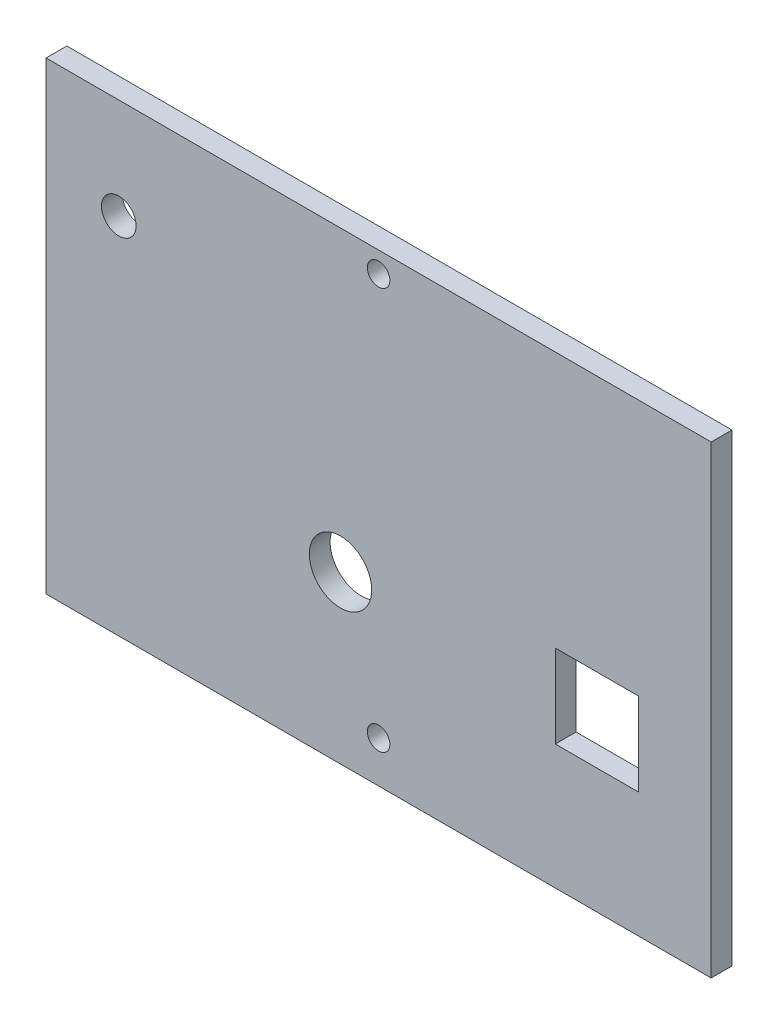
ISO-10303-21;
HEADER;
FILE_DESCRIPTION(('STEP AP214'),'2;1');
FILE_NAME('part.step','',(''),(''),'','','');
FILE_SCHEMA(('AUTOMOTIVE_DESIGN { 1 0 10303 214 1 1 1 1 }'));
ENDSEC;
DATA;
#1=APPLICATION_CONTEXT('core data for automotive mechanical design processes');
#2=APPLICATION_PROTOCOL_DEFINITION('international standard','automotive_design',2000,#1);
#3=PRODUCT_CONTEXT('',#1,'mechanical');
#4=PRODUCT('Part','Part','',(#3));
#5=PRODUCT_RELATED_PRODUCT_CATEGORY('part','',(#4));
#6=PRODUCT_DEFINITION_FORMATION('','',#4);
#7=PRODUCT_DEFINITION_CONTEXT('part definition',#1,'design');
#8=PRODUCT_DEFINITION('design','',#6,#7);
#9=PRODUCT_DEFINITION_SHAPE('','',#8);
#10=(LENGTH_UNIT() NAMED_UNIT(*) SI_UNIT(.MILLI.,.METRE.));
#11=(NAMED_UNIT(*) PLANE_ANGLE_UNIT() SI_UNIT($,.RADIAN.));
#12=(NAMED_UNIT(*) SI_UNIT($,.STERADIAN.) SOLID_ANGLE_UNIT());
#13=UNCERTAINTY_MEASURE_WITH_UNIT(LENGTH_MEASURE(1.E-05),#10,'distance_accuracy_value','');
#14=(GEOMETRIC_REPRESENTATION_CONTEXT(3) GLOBAL_UNCERTAINTY_ASSIGNED_CONTEXT((#13)) GLOBAL_UNIT_ASSIGNED_CONTEXT((#10,
#11,#12)) REPRESENTATION_CONTEXT('',''));
#15=CARTESIAN_POINT('',(0.,0.,0.));
#16=DIRECTION('',(0.,0.,1.));
#17=DIRECTION('',(1.,0.,0.));
#18=AXIS2_PLACEMENT_3D('',#15,#16,#17);
#19=CARTESIAN_POINT('',(48.,-33.5,3.));
#20=DIRECTION('',(-1.,0.,0.));
#21=DIRECTION('',(0.,0.,1.));
#22=AXIS2_PLACEMENT_3D('',#19,#20,#21);
#23=PLANE('',#22);
#24=DIRECTION('',(0.,1.,0.));
#25=VECTOR('',#24,1.);
#26=CARTESIAN_POINT('',(48.,-33.5,0.));
#27=LINE('',#26,#25);
#28=CARTESIAN_POINT('',(48.,-33.5,0.));
#29=VERTEX_POINT('',#28);
#30=CARTESIAN_POINT('',(48.,33.5,0.));
#31=VERTEX_POINT('',#30);
#32=EDGE_CURVE('E165',#29,#31,#27,.T.);
#33=ORIENTED_EDGE('',*,*,#32,.T.);
#34=DIRECTION('',(0.,0.,-1.));
#35=VECTOR('',#34,1.);
#36=CARTESIAN_POINT('',(48.,33.5,3.));
#37=LINE('',#36,#35);
#38=CARTESIAN_POINT('',(48.,33.5,3.));
#39=VERTEX_POINT('',#38);
#40=EDGE_CURVE('E11',#39,#31,#37,.T.);
#41=ORIENTED_EDGE('',*,*,#40,.F.);
#42=DIRECTION('',(0.,1.,0.));
#43=VECTOR('',#42,1.);
#44=CARTESIAN_POINT('',(48.,-33.5,3.));
#45=LINE('',#44,#43);
#46=CARTESIAN_POINT('',(48.,-33.5,3.));
#47=VERTEX_POINT('',#46);
#48=EDGE_CURVE('E150',#47,#39,#45,.T.);
#49=ORIENTED_EDGE('',*,*,#48,.F.);
#50=DIRECTION('',(0.,0.,-1.));
#51=VECTOR('',#50,1.);
#52=CARTESIAN_POINT('',(48.,-33.5,3.));
#53=LINE('',#52,#51);
#54=EDGE_CURVE('E164',#47,#29,#53,.T.);
#55=ORIENTED_EDGE('',*,*,#54,.T.);
#56=EDGE_LOOP('',(#33,#41,#49,#55));
#57=FACE_BOUND('',#56,.T.);
#58=ADVANCED_FACE('F43',(#57),#23,.F.);
#59=CARTESIAN_POINT('',(-48.,33.5,3.));
#60=DIRECTION('',(0.,-1.,0.));
#61=DIRECTION('',(0.,0.,-1.));
#62=AXIS2_PLACEMENT_3D('',#59,#60,#61);
#63=PLANE('',#62);
#64=DIRECTION('',(-1.,0.,0.));
#65=VECTOR('',#64,1.);
#66=CARTESIAN_POINT('',(-48.,33.5,0.));
#67=LINE('',#66,#65);
#68=CARTESIAN_POINT('',(-48.,33.5,0.));
#69=VERTEX_POINT('',#68);
#70=EDGE_CURVE('E169',#31,#69,#67,.T.);
#71=ORIENTED_EDGE('',*,*,#70,.T.);
#72=DIRECTION('',(0.,0.,-1.));
#73=VECTOR('',#72,1.);
#74=CARTESIAN_POINT('',(-48.,33.5,3.));
#75=LINE('',#74,#73);
#76=CARTESIAN_POINT('',(-48.,33.5,3.));
#77=VERTEX_POINT('',#76);
#78=EDGE_CURVE('E51',#77,#69,#75,.T.);
#79=ORIENTED_EDGE('',*,*,#78,.F.);
#80=DIRECTION('',(-1.,0.,0.));
#81=VECTOR('',#80,1.);
#82=CARTESIAN_POINT('',(-48.,33.5,3.));
#83=LINE('',#82,#81);
#84=EDGE_CURVE('E154',#39,#77,#83,.T.);
#85=ORIENTED_EDGE('',*,*,#84,.F.);
#86=ORIENTED_EDGE('',*,*,#40,.T.);
#87=EDGE_LOOP('',(#71,#79,#85,#86));
#88=FACE_BOUND('',#87,.T.);
#89=ADVANCED_FACE('F205',(#88),#63,.F.);
#90=CARTESIAN_POINT('',(-48.,-33.5,3.));
#91=DIRECTION('',(1.,0.,0.));
#92=DIRECTION('',(0.,0.,-1.));
#93=AXIS2_PLACEMENT_3D('',#90,#91,#92);
#94=PLANE('',#93);
#95=DIRECTION('',(0.,-1.,0.));
#96=VECTOR('',#95,1.);
#97=CARTESIAN_POINT('',(-48.,-33.5,0.));
#98=LINE('',#97,#96);
#99=CARTESIAN_POINT('',(-48.,-33.5,0.));
#100=VERTEX_POINT('',#99);
#101=EDGE_CURVE('E173',#69,#100,#98,.T.);
#102=ORIENTED_EDGE('',*,*,#101,.T.);
#103=DIRECTION('',(0.,0.,-1.));
#104=VECTOR('',#103,1.);
#105=CARTESIAN_POINT('',(-48.,-33.5,3.));
#106=LINE('',#105,#104);
#107=CARTESIAN_POINT('',(-48.,-33.5,3.));
#108=VERTEX_POINT('',#107);
#109=EDGE_CURVE('E181',#108,#100,#106,.T.);
#110=ORIENTED_EDGE('',*,*,#109,.F.);
#111=DIRECTION('',(0.,-1.,0.));
#112=VECTOR('',#111,1.);
#113=CARTESIAN_POINT('',(-48.,-33.5,3.));
#114=LINE('',#113,#112);
#115=EDGE_CURVE('E158',#77,#108,#114,.T.);
#116=ORIENTED_EDGE('',*,*,#115,.F.);
#117=ORIENTED_EDGE('',*,*,#78,.T.);
#118=EDGE_LOOP('',(#102,#110,#116,#117));
#119=FACE_BOUND('',#118,.T.);
#120=ADVANCED_FACE('F190',(#119),#94,.F.);
#121=CARTESIAN_POINT('',(-48.,-33.5,3.));
#122=DIRECTION('',(0.,1.,0.));
#123=DIRECTION('',(0.,0.,1.));
#124=AXIS2_PLACEMENT_3D('',#121,#122,#123);
#125=PLANE('',#124);
#126=DIRECTION('',(1.,0.,0.));
#127=VECTOR('',#126,1.);
#128=CARTESIAN_POINT('',(-48.,-33.5,0.));
#129=LINE('',#128,#127);
#130=EDGE_CURVE('E155',#100,#29,#129,.T.);
#131=ORIENTED_EDGE('',*,*,#130,.T.);
#132=ORIENTED_EDGE('',*,*,#54,.F.);
#133=DIRECTION('',(1.,0.,0.));
#134=VECTOR('',#133,1.);
#135=CARTESIAN_POINT('',(-48.,-33.5,3.));
#136=LINE('',#135,#134);
#137=EDGE_CURVE('E161',#108,#47,#136,.T.);
#138=ORIENTED_EDGE('',*,*,#137,.F.);
#139=ORIENTED_EDGE('',*,*,#109,.T.);
#140=EDGE_LOOP('',(#131,#132,#138,#139));
#141=FACE_BOUND('',#140,.T.);
#142=ADVANCED_FACE('F198',(#141),#125,.F.);
#143=CARTESIAN_POINT('',(0.,0.,3.));
#144=DIRECTION('',(0.,0.,-1.));
#145=DIRECTION('',(-1.,0.,0.));
#146=AXIS2_PLACEMENT_3D('',#143,#144,#145);
#147=PLANE('',#146);
#148=CARTESIAN_POINT('',(-37.5,19.,3.));
#149=DIRECTION('',(0.,0.,1.));
#150=DIRECTION('',(1.,0.,0.));
#151=AXIS2_PLACEMENT_3D('',#148,#149,#150);
#152=CIRCLE('',#151,2.5);
#153=CARTESIAN_POINT('',(-35.,19.,3.));
#154=VERTEX_POINT('',#153);
#155=EDGE_CURVE('E170',#154,#154,#152,.T.);
#156=ORIENTED_EDGE('',*,*,#155,.F.);
#157=EDGE_LOOP('',(#156));
#158=FACE_BOUND('',#157,.T.);
#159=CARTESIAN_POINT('',(0.,-27.5000000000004,3.));
#160=DIRECTION('',(0.,0.,1.));
#161=DIRECTION('',(1.,0.,0.));
#162=AXIS2_PLACEMENT_3D('',#159,#160,#161);
#163=CIRCLE('',#162,1.625);
#164=CARTESIAN_POINT('',(1.625,-27.5000000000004,3.));
#165=VERTEX_POINT('',#164);
#166=EDGE_CURVE('E277',#165,#165,#163,.T.);
#167=ORIENTED_EDGE('',*,*,#166,.F.);
#168=EDGE_LOOP('',(#167));
#169=FACE_BOUND('',#168,.T.);
#170=CARTESIAN_POINT('',(0.,30.5,3.));
#171=DIRECTION('',(0.,0.,1.));
#172=DIRECTION('',(1.,0.,0.));
#173=AXIS2_PLACEMENT_3D('',#170,#171,#172);
#174=CIRCLE('',#173,1.625);
#175=CARTESIAN_POINT('',(1.62499999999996,30.5,3.));
#176=VERTEX_POINT('',#175);
#177=EDGE_CURVE('E269',#176,#176,#174,.T.);
#178=ORIENTED_EDGE('',*,*,#177,.F.);
#179=EDGE_LOOP('',(#178));
#180=FACE_BOUND('',#179,.T.);
#181=DIRECTION('',(0.,1.,0.));
#182=VECTOR('',#181,1.);
#183=CARTESIAN_POINT('',(37.5,-3.50000000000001,3.));
#184=LINE('',#183,#182);
#185=CARTESIAN_POINT('',(37.5,-15.5,3.));
#186=VERTEX_POINT('',#185);
#187=CARTESIAN_POINT('',(37.5,-3.50000000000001,3.));
#188=VERTEX_POINT('',#187);
#189=EDGE_CURVE('E126',#186,#188,#184,.T.);
#190=ORIENTED_EDGE('',*,*,#189,.F.);
#191=DIRECTION('',(1.,0.,0.));
#192=VECTOR('',#191,1.);
#193=CARTESIAN_POINT('',(25.5,-15.5,3.));
#194=LINE('',#193,#192);
#195=CARTESIAN_POINT('',(25.5,-15.5,3.));
#196=VERTEX_POINT('',#195);
#197=EDGE_CURVE('E140',#196,#186,#194,.T.);
#198=ORIENTED_EDGE('',*,*,#197,.F.);
#199=DIRECTION('',(0.,-1.,0.));
#200=VECTOR('',#199,1.);
#201=CARTESIAN_POINT('',(25.5,-3.50000000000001,3.));
#202=LINE('',#201,#200);
#203=CARTESIAN_POINT('',(25.5,-3.50000000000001,3.));
#204=VERTEX_POINT('',#203);
#205=EDGE_CURVE('E115',#204,#196,#202,.T.);
#206=ORIENTED_EDGE('',*,*,#205,.F.);
#207=DIRECTION('',(-1.,0.,0.));
#208=VECTOR('',#207,1.);
#209=CARTESIAN_POINT('',(25.5,-3.50000000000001,3.));
#210=LINE('',#209,#208);
#211=EDGE_CURVE('E145',#188,#204,#210,.T.);
#212=ORIENTED_EDGE('',*,*,#211,.F.);
#213=EDGE_LOOP('',(#190,#198,#206,#212));
#214=FACE_BOUND('',#213,.T.);
#215=CARTESIAN_POINT('',(-5.50000000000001,-9.50000000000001,3.));
#216=DIRECTION('',(0.,0.,1.));
#217=DIRECTION('',(1.,0.,0.));
#218=AXIS2_PLACEMENT_3D('',#215,#216,#217);
#219=CIRCLE('',#218,4.5);
#220=CARTESIAN_POINT('',(-1.00000000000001,-9.50000000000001,3.));
#221=VERTEX_POINT('',#220);
#222=EDGE_CURVE('E139',#221,#221,#219,.T.);
#223=ORIENTED_EDGE('',*,*,#222,.F.);
#224=EDGE_LOOP('',(#223));
#225=FACE_BOUND('',#224,.T.);
#226=ORIENTED_EDGE('',*,*,#48,.T.);
#227=ORIENTED_EDGE('',*,*,#84,.T.);
#228=ORIENTED_EDGE('',*,*,#115,.T.);
#229=ORIENTED_EDGE('',*,*,#137,.T.);
#230=EDGE_LOOP('',(#226,#227,#228,#229));
#231=FACE_BOUND('',#230,.T.);
#232=ADVANCED_FACE('F204',(#158,#169,#180,#214,#225,#231),#147,.F.);
#233=CARTESIAN_POINT('',(0.,0.,0.));
#234=DIRECTION('',(0.,0.,-1.));
#235=DIRECTION('',(-1.,0.,0.));
#236=AXIS2_PLACEMENT_3D('',#233,#234,#235);
#237=PLANE('',#236);
#238=CARTESIAN_POINT('',(-37.5,19.,0.));
#239=DIRECTION('',(0.,0.,1.));
#240=DIRECTION('',(1.,0.,0.));
#241=AXIS2_PLACEMENT_3D('',#238,#239,#240);
#242=CIRCLE('',#241,2.5);
#243=CARTESIAN_POINT('',(-35.,19.,0.));
#244=VERTEX_POINT('',#243);
#245=EDGE_CURVE('E254',#244,#244,#242,.T.);
#246=ORIENTED_EDGE('',*,*,#245,.T.);
#247=EDGE_LOOP('',(#246));
#248=FACE_BOUND('',#247,.T.);
#249=CARTESIAN_POINT('',(0.,-27.5000000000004,0.));
#250=DIRECTION('',(0.,0.,1.));
#251=DIRECTION('',(1.,0.,0.));
#252=AXIS2_PLACEMENT_3D('',#249,#250,#251);
#253=CIRCLE('',#252,1.625);
#254=CARTESIAN_POINT('',(1.625,-27.5000000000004,0.));
#255=VERTEX_POINT('',#254);
#256=EDGE_CURVE('E273',#255,#255,#253,.T.);
#257=ORIENTED_EDGE('',*,*,#256,.T.);
#258=EDGE_LOOP('',(#257));
#259=FACE_BOUND('',#258,.T.);
#260=CARTESIAN_POINT('',(0.,30.5,0.));
#261=DIRECTION('',(0.,0.,1.));
#262=DIRECTION('',(1.,0.,0.));
#263=AXIS2_PLACEMENT_3D('',#260,#261,#262);
#264=CIRCLE('',#263,1.625);
#265=CARTESIAN_POINT('',(1.62499999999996,30.5,0.));
#266=VERTEX_POINT('',#265);
#267=EDGE_CURVE('E264',#266,#266,#264,.T.);
#268=ORIENTED_EDGE('',*,*,#267,.T.);
#269=EDGE_LOOP('',(#268));
#270=FACE_BOUND('',#269,.T.);
#271=DIRECTION('',(1.,0.,0.));
#272=VECTOR('',#271,1.);
#273=CARTESIAN_POINT('',(25.5,-15.5,0.));
#274=LINE('',#273,#272);
#275=CARTESIAN_POINT('',(25.5,-15.5,0.));
#276=VERTEX_POINT('',#275);
#277=CARTESIAN_POINT('',(37.5,-15.5,0.));
#278=VERTEX_POINT('',#277);
#279=EDGE_CURVE('E122',#276,#278,#274,.T.);
#280=ORIENTED_EDGE('',*,*,#279,.T.);
#281=DIRECTION('',(0.,1.,0.));
#282=VECTOR('',#281,1.);
#283=CARTESIAN_POINT('',(37.5,-3.50000000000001,0.));
#284=LINE('',#283,#282);
#285=CARTESIAN_POINT('',(37.5,-3.50000000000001,0.));
#286=VERTEX_POINT('',#285);
#287=EDGE_CURVE('E66',#278,#286,#284,.T.);
#288=ORIENTED_EDGE('',*,*,#287,.T.);
#289=DIRECTION('',(-1.,0.,0.));
#290=VECTOR('',#289,1.);
#291=CARTESIAN_POINT('',(25.5,-3.50000000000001,0.));
#292=LINE('',#291,#290);
#293=CARTESIAN_POINT('',(25.5,-3.50000000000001,0.));
#294=VERTEX_POINT('',#293);
#295=EDGE_CURVE('E130',#286,#294,#292,.T.);
#296=ORIENTED_EDGE('',*,*,#295,.T.);
#297=DIRECTION('',(0.,-1.,0.));
#298=VECTOR('',#297,1.);
#299=CARTESIAN_POINT('',(25.5,-3.50000000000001,0.));
#300=LINE('',#299,#298);
#301=EDGE_CURVE('E112',#294,#276,#300,.T.);
#302=ORIENTED_EDGE('',*,*,#301,.T.);
#303=EDGE_LOOP('',(#280,#288,#296,#302));
#304=FACE_BOUND('',#303,.T.);
#305=CARTESIAN_POINT('',(-5.50000000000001,-9.50000000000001,0.));
#306=DIRECTION('',(0.,0.,1.));
#307=DIRECTION('',(1.,0.,0.));
#308=AXIS2_PLACEMENT_3D('',#305,#306,#307);
#309=CIRCLE('',#308,4.5);
#310=CARTESIAN_POINT('',(-1.00000000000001,-9.50000000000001,0.));
#311=VERTEX_POINT('',#310);
#312=EDGE_CURVE('E256',#311,#311,#309,.T.);
#313=ORIENTED_EDGE('',*,*,#312,.T.);
#314=EDGE_LOOP('',(#313));
#315=FACE_BOUND('',#314,.T.);
#316=ORIENTED_EDGE('',*,*,#32,.F.);
#317=ORIENTED_EDGE('',*,*,#130,.F.);
#318=ORIENTED_EDGE('',*,*,#101,.F.);
#319=ORIENTED_EDGE('',*,*,#70,.F.);
#320=EDGE_LOOP('',(#316,#317,#318,#319));
#321=FACE_BOUND('',#320,.T.);
#322=ADVANCED_FACE('F128',(#248,#259,#270,#304,#315,#321),#237,.T.);
#323=CARTESIAN_POINT('',(-5.50000000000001,-9.50000000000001,3.));
#324=DIRECTION('',(0.,0.,-1.));
#325=DIRECTION('',(-1.,0.,0.));
#326=AXIS2_PLACEMENT_3D('',#323,#324,#325);
#327=CYLINDRICAL_SURFACE('',#326,4.5);
#328=ORIENTED_EDGE('',*,*,#222,.T.);
#329=EDGE_LOOP('',(#328));
#330=FACE_BOUND('',#329,.T.);
#331=ORIENTED_EDGE('',*,*,#312,.F.);
#332=EDGE_LOOP('',(#331));
#333=FACE_BOUND('',#332,.T.);
#334=ADVANCED_FACE('F217',(#330,#333),#327,.F.);
#335=CARTESIAN_POINT('',(37.5,-3.50000000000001,3.));
#336=DIRECTION('',(-1.,0.,0.));
#337=DIRECTION('',(0.,0.,1.));
#338=AXIS2_PLACEMENT_3D('',#335,#336,#337);
#339=PLANE('',#338);
#340=ORIENTED_EDGE('',*,*,#287,.F.);
#341=DIRECTION('',(0.,0.,-1.));
#342=VECTOR('',#341,1.);
#343=CARTESIAN_POINT('',(37.5,-15.5,3.));
#344=LINE('',#343,#342);
#345=EDGE_CURVE('E118',#186,#278,#344,.T.);
#346=ORIENTED_EDGE('',*,*,#345,.F.);
#347=ORIENTED_EDGE('',*,*,#189,.T.);
#348=DIRECTION('',(0.,0.,-1.));
#349=VECTOR('',#348,1.);
#350=CARTESIAN_POINT('',(37.5,-3.50000000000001,3.));
#351=LINE('',#350,#349);
#352=EDGE_CURVE('E268',#188,#286,#351,.T.);
#353=ORIENTED_EDGE('',*,*,#352,.T.);
#354=EDGE_LOOP('',(#340,#346,#347,#353));
#355=FACE_BOUND('',#354,.T.);
#356=ADVANCED_FACE('F230',(#355),#339,.T.);
#357=CARTESIAN_POINT('',(25.5,-3.50000000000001,3.));
#358=DIRECTION('',(0.,-1.,0.));
#359=DIRECTION('',(0.,0.,-1.));
#360=AXIS2_PLACEMENT_3D('',#357,#358,#359);
#361=PLANE('',#360);
#362=ORIENTED_EDGE('',*,*,#295,.F.);
#363=ORIENTED_EDGE('',*,*,#352,.F.);
#364=ORIENTED_EDGE('',*,*,#211,.T.);
#365=DIRECTION('',(0.,0.,-1.));
#366=VECTOR('',#365,1.);
#367=CARTESIAN_POINT('',(25.5,-3.50000000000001,3.));
#368=LINE('',#367,#366);
#369=EDGE_CURVE('E119',#204,#294,#368,.T.);
#370=ORIENTED_EDGE('',*,*,#369,.T.);
#371=EDGE_LOOP('',(#362,#363,#364,#370));
#372=FACE_BOUND('',#371,.T.);
#373=ADVANCED_FACE('F227',(#372),#361,.T.);
#374=CARTESIAN_POINT('',(25.5,-3.50000000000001,3.));
#375=DIRECTION('',(1.,0.,0.));
#376=DIRECTION('',(0.,0.,-1.));
#377=AXIS2_PLACEMENT_3D('',#374,#375,#376);
#378=PLANE('',#377);
#379=ORIENTED_EDGE('',*,*,#301,.F.);
#380=ORIENTED_EDGE('',*,*,#369,.F.);
#381=ORIENTED_EDGE('',*,*,#205,.T.);
#382=DIRECTION('',(0.,0.,-1.));
#383=VECTOR('',#382,1.);
#384=CARTESIAN_POINT('',(25.5,-15.5,3.));
#385=LINE('',#384,#383);
#386=EDGE_CURVE('E58',#196,#276,#385,.T.);
#387=ORIENTED_EDGE('',*,*,#386,.T.);
#388=EDGE_LOOP('',(#379,#380,#381,#387));
#389=FACE_BOUND('',#388,.T.);
#390=ADVANCED_FACE('F109',(#389),#378,.T.);
#391=CARTESIAN_POINT('',(25.5,-15.5,3.));
#392=DIRECTION('',(0.,1.,0.));
#393=DIRECTION('',(0.,0.,1.));
#394=AXIS2_PLACEMENT_3D('',#391,#392,#393);
#395=PLANE('',#394);
#396=ORIENTED_EDGE('',*,*,#279,.F.);
#397=ORIENTED_EDGE('',*,*,#386,.F.);
#398=ORIENTED_EDGE('',*,*,#197,.T.);
#399=ORIENTED_EDGE('',*,*,#345,.T.);
#400=EDGE_LOOP('',(#396,#397,#398,#399));
#401=FACE_BOUND('',#400,.T.);
#402=ADVANCED_FACE('F123',(#401),#395,.T.);
#403=CARTESIAN_POINT('',(0.,30.5,3.));
#404=DIRECTION('',(0.,0.,-1.));
#405=DIRECTION('',(-1.,0.,0.));
#406=AXIS2_PLACEMENT_3D('',#403,#404,#405);
#407=CYLINDRICAL_SURFACE('',#406,1.625);
#408=ORIENTED_EDGE('',*,*,#177,.T.);
#409=EDGE_LOOP('',(#408));
#410=FACE_BOUND('',#409,.T.);
#411=ORIENTED_EDGE('',*,*,#267,.F.);
#412=EDGE_LOOP('',(#411));
#413=FACE_BOUND('',#412,.T.);
#414=ADVANCED_FACE('F224',(#410,#413),#407,.F.);
#415=CARTESIAN_POINT('',(0.,-27.5000000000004,3.));
#416=DIRECTION('',(0.,0.,-1.));
#417=DIRECTION('',(-1.,0.,0.));
#418=AXIS2_PLACEMENT_3D('',#415,#416,#417);
#419=CYLINDRICAL_SURFACE('',#418,1.625);
#420=ORIENTED_EDGE('',*,*,#166,.T.);
#421=EDGE_LOOP('',(#420));
#422=FACE_BOUND('',#421,.T.);
#423=ORIENTED_EDGE('',*,*,#256,.F.);
#424=EDGE_LOOP('',(#423));
#425=FACE_BOUND('',#424,.T.);
#426=ADVANCED_FACE('F237',(#422,#425),#419,.F.);
#427=CARTESIAN_POINT('',(-37.5,19.,3.));
#428=DIRECTION('',(0.,0.,-1.));
#429=DIRECTION('',(-1.,0.,0.));
#430=AXIS2_PLACEMENT_3D('',#427,#428,#429);
#431=CYLINDRICAL_SURFACE('',#430,2.5);
#432=ORIENTED_EDGE('',*,*,#155,.T.);
#433=EDGE_LOOP('',(#432));
#434=FACE_BOUND('',#433,.T.);
#435=ORIENTED_EDGE('',*,*,#245,.F.);
#436=EDGE_LOOP('',(#435));
#437=FACE_BOUND('',#436,.T.);
#438=ADVANCED_FACE('F240',(#434,#437),#431,.F.);
#439=CLOSED_SHELL('',(#58,#89,#120,#142,#232,#322,#334,#356,#373,#390,#402,#414,#426,#438));
#440=MANIFOLD_SOLID_BREP('B2',#439);
#441=ADVANCED_BREP_SHAPE_REPRESENTATION('',(#18,#440),#14);
#442=SHAPE_DEFINITION_REPRESENTATION(#9,#441);
ENDSEC;
END-ISO-10303-21;
